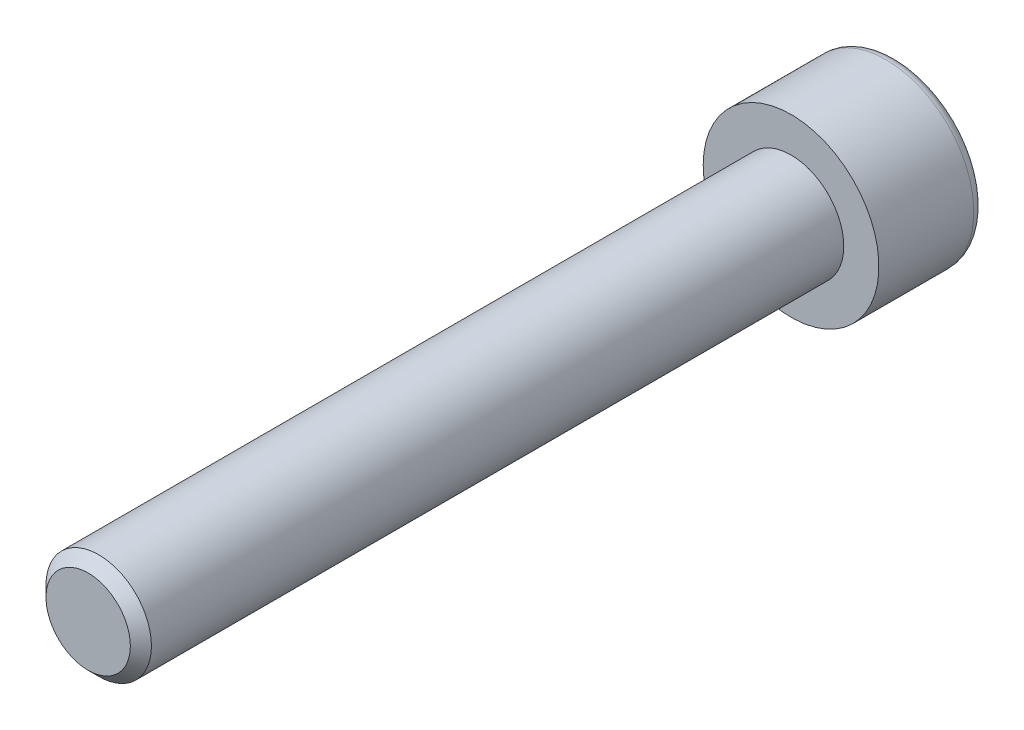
ISO-10303-21;
HEADER;
FILE_DESCRIPTION(('STEP AP214'),'2;1');
FILE_NAME('part.step','',(''),(''),'','','');
FILE_SCHEMA(('AUTOMOTIVE_DESIGN { 1 0 10303 214 1 1 1 1 }'));
ENDSEC;
DATA;
#1=APPLICATION_CONTEXT('core data for automotive mechanical design processes');
#2=APPLICATION_PROTOCOL_DEFINITION('international standard','automotive_design',2000,#1);
#3=PRODUCT_CONTEXT('',#1,'mechanical');
#4=PRODUCT('Part','Part','',(#3));
#5=PRODUCT_RELATED_PRODUCT_CATEGORY('part','',(#4));
#6=PRODUCT_DEFINITION_FORMATION('','',#4);
#7=PRODUCT_DEFINITION_CONTEXT('part definition',#1,'design');
#8=PRODUCT_DEFINITION('design','',#6,#7);
#9=PRODUCT_DEFINITION_SHAPE('','',#8);
#10=(LENGTH_UNIT() NAMED_UNIT(*) SI_UNIT(.MILLI.,.METRE.));
#11=(NAMED_UNIT(*) PLANE_ANGLE_UNIT() SI_UNIT($,.RADIAN.));
#12=(NAMED_UNIT(*) SI_UNIT($,.STERADIAN.) SOLID_ANGLE_UNIT());
#13=UNCERTAINTY_MEASURE_WITH_UNIT(LENGTH_MEASURE(1.E-05),#10,'distance_accuracy_value','');
#14=(GEOMETRIC_REPRESENTATION_CONTEXT(3) GLOBAL_UNCERTAINTY_ASSIGNED_CONTEXT((#13)) GLOBAL_UNIT_ASSIGNED_CONTEXT((#10,
#11,#12)) REPRESENTATION_CONTEXT('',''));
#15=CARTESIAN_POINT('',(0.,0.,0.));
#16=DIRECTION('',(0.,0.,1.));
#17=DIRECTION('',(1.,0.,0.));
#18=AXIS2_PLACEMENT_3D('',#15,#16,#17);
#19=CARTESIAN_POINT('',(4.44089209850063E-13,-1.11022302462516E-13,-5.9999999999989));
#20=DIRECTION('',(0.,0.,0.999999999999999));
#21=DIRECTION('',(0.999999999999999,0.,0.));
#22=AXIS2_PLACEMENT_3D('',#19,#20,#21);
#23=PLANE('',#22);
#24=CARTESIAN_POINT('',(4.44089209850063E-13,-1.11022302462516E-13,-5.9999999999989));
#25=DIRECTION('',(0.,0.,-0.999999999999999));
#26=DIRECTION('',(-0.999999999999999,0.,0.));
#27=AXIS2_PLACEMENT_3D('',#24,#25,#26);
#28=CIRCLE('',#27,4.4);
#29=CARTESIAN_POINT('',(-4.39999999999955,-1.135869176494E-13,-5.99999999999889));
#30=VERTEX_POINT('',#29);
#31=EDGE_CURVE('E146',#30,#30,#28,.T.);
#32=ORIENTED_EDGE('',*,*,#31,.T.);
#33=EDGE_LOOP('',(#32));
#34=FACE_BOUND('',#33,.T.);
#35=DIRECTION('',(-0.866025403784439,0.499999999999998,0.));
#36=VECTOR('',#35,1.);
#37=CARTESIAN_POINT('',(9.99200722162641E-13,2.88675134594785,-5.9999999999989));
#38=LINE('',#37,#36);
#39=CARTESIAN_POINT('',(2.50000000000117,1.44337567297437,-5.99999999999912));
#40=VERTEX_POINT('',#39);
#41=CARTESIAN_POINT('',(9.99200722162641E-13,2.88675134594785,-5.9999999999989));
#42=VERTEX_POINT('',#41);
#43=EDGE_CURVE('E50',#40,#42,#38,.T.);
#44=ORIENTED_EDGE('',*,*,#43,.T.);
#45=DIRECTION('',(-0.866025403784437,-0.500000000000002,0.));
#46=VECTOR('',#45,1.);
#47=CARTESIAN_POINT('',(9.99200722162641E-13,2.88675134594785,-5.9999999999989));
#48=LINE('',#47,#46);
#49=CARTESIAN_POINT('',(-2.49999999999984,1.44337567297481,-5.99999999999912));
#50=VERTEX_POINT('',#49);
#51=EDGE_CURVE('E90',#42,#50,#48,.T.);
#52=ORIENTED_EDGE('',*,*,#51,.T.);
#53=DIRECTION('',(0.,-1.,0.));
#54=VECTOR('',#53,1.);
#55=CARTESIAN_POINT('',(-2.50000000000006,-1.4433756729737,-5.9999999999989));
#56=LINE('',#55,#54);
#57=CARTESIAN_POINT('',(-2.50000000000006,-1.4433756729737,-5.9999999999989));
#58=VERTEX_POINT('',#57);
#59=EDGE_CURVE('E98',#50,#58,#56,.T.);
#60=ORIENTED_EDGE('',*,*,#59,.T.);
#61=DIRECTION('',(0.866025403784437,-0.500000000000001,0.));
#62=VECTOR('',#61,1.);
#63=CARTESIAN_POINT('',(1.11022302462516E-13,-2.88675134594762,-5.99999999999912));
#64=LINE('',#63,#62);
#65=CARTESIAN_POINT('',(1.11022302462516E-13,-2.88675134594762,-5.99999999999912));
#66=VERTEX_POINT('',#65);
#67=EDGE_CURVE('E116',#58,#66,#64,.T.);
#68=ORIENTED_EDGE('',*,*,#67,.T.);
#69=DIRECTION('',(0.866025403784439,0.499999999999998,0.));
#70=VECTOR('',#69,1.);
#71=CARTESIAN_POINT('',(1.11022302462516E-13,-2.88675134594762,-5.99999999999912));
#72=LINE('',#71,#70);
#73=CARTESIAN_POINT('',(2.50000000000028,-1.44337567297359,-5.99999999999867));
#74=VERTEX_POINT('',#73);
#75=EDGE_CURVE('E119',#66,#74,#72,.T.);
#76=ORIENTED_EDGE('',*,*,#75,.T.);
#77=DIRECTION('',(0.,1.,0.));
#78=VECTOR('',#77,1.);
#79=CARTESIAN_POINT('',(2.50000000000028,-1.44337567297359,-5.99999999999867));
#80=LINE('',#79,#78);
#81=EDGE_CURVE('E109',#74,#40,#80,.T.);
#82=ORIENTED_EDGE('',*,*,#81,.T.);
#83=EDGE_LOOP('',(#44,#52,#60,#68,#76,#82));
#84=FACE_BOUND('',#83,.T.);
#85=ADVANCED_FACE('F36',(#34,#84),#23,.F.);
#86=CARTESIAN_POINT('',(5.55111512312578E-13,0.,-5.39999999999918));
#87=DIRECTION('',(0.,0.,-0.999999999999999));
#88=DIRECTION('',(-0.999999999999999,0.,0.));
#89=AXIS2_PLACEMENT_3D('',#86,#87,#88);
#90=TOROIDAL_SURFACE('',#89,4.4,0.6);
#91=ORIENTED_EDGE('',*,*,#31,.F.);
#92=EDGE_LOOP('',(#91));
#93=FACE_BOUND('',#92,.T.);
#94=CARTESIAN_POINT('',(5.55111512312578E-13,0.,-5.39999999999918));
#95=DIRECTION('',(0.,0.,-0.999999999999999));
#96=DIRECTION('',(-0.999999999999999,0.,0.));
#97=AXIS2_PLACEMENT_3D('',#94,#95,#96);
#98=CIRCLE('',#97,5.);
#99=CARTESIAN_POINT('',(-4.99999999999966,-1.13636877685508E-13,-5.39999999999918));
#100=VERTEX_POINT('',#99);
#101=EDGE_CURVE('E143',#100,#100,#98,.T.);
#102=ORIENTED_EDGE('',*,*,#101,.T.);
#103=EDGE_LOOP('',(#102));
#104=FACE_BOUND('',#103,.T.);
#105=ADVANCED_FACE('F165',(#93,#104),#90,.T.);
#106=CARTESIAN_POINT('',(3.33066907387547E-13,-1.11022302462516E-13,4.44089209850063E-13));
#107=DIRECTION('',(0.,0.,-0.999999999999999));
#108=DIRECTION('',(-0.999999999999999,0.,0.));
#109=AXIS2_PLACEMENT_3D('',#106,#107,#108);
#110=CYLINDRICAL_SURFACE('',#109,5.);
#111=CARTESIAN_POINT('',(3.33066907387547E-13,-1.11022302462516E-13,4.44089209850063E-13));
#112=DIRECTION('',(0.,0.,-0.999999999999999));
#113=DIRECTION('',(-0.999999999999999,0.,0.));
#114=AXIS2_PLACEMENT_3D('',#111,#112,#113);
#115=CIRCLE('',#114,5.);
#116=CARTESIAN_POINT('',(-4.99999999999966,-1.13936637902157E-13,4.43256542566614E-13));
#117=VERTEX_POINT('',#116);
#118=EDGE_CURVE('E104',#117,#117,#115,.T.);
#119=CARTESIAN_POINT('',(-4.99999999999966,-1.13636877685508E-13,-5.39999999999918));
#120=CARTESIAN_POINT('',(-4.99999999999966,-1.13640000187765E-13,-5.34374999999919));
#121=CARTESIAN_POINT('',(-4.99999999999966,-1.13643122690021E-13,-5.28749999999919));
#122=CARTESIAN_POINT('',(-4.99999999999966,-1.13649367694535E-13,-5.1749999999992));
#123=CARTESIAN_POINT('',(-4.99999999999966,-1.13652490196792E-13,-5.1187499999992));
#124=CARTESIAN_POINT('',(-4.99999999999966,-1.13658735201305E-13,-5.00624999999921));
#125=CARTESIAN_POINT('',(-4.99999999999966,-1.13661857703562E-13,-4.94999999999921));
#126=CARTESIAN_POINT('',(-4.99999999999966,-1.13668102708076E-13,-4.83749999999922));
#127=CARTESIAN_POINT('',(-4.99999999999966,-1.13671225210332E-13,-4.78124999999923));
#128=CARTESIAN_POINT('',(-4.99999999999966,-1.13677470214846E-13,-4.66874999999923));
#129=CARTESIAN_POINT('',(-4.99999999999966,-1.13680592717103E-13,-4.61249999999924));
#130=CARTESIAN_POINT('',(-4.99999999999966,-1.13686837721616E-13,-4.49999999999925));
#131=CARTESIAN_POINT('',(-4.99999999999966,-1.13689960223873E-13,-4.44374999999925));
#132=CARTESIAN_POINT('',(-4.99999999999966,-1.13696205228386E-13,-4.33124999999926));
#133=CARTESIAN_POINT('',(-4.99999999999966,-1.13699327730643E-13,-4.27499999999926));
#134=CARTESIAN_POINT('',(-4.99999999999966,-1.13705572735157E-13,-4.16249999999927));
#135=CARTESIAN_POINT('',(-4.99999999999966,-1.13708695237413E-13,-4.10624999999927));
#136=CARTESIAN_POINT('',(-4.99999999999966,-1.13714940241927E-13,-3.99374999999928));
#137=CARTESIAN_POINT('',(-4.99999999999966,-1.13718062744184E-13,-3.93749999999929));
#138=CARTESIAN_POINT('',(-4.99999999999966,-1.13724307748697E-13,-3.82499999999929));
#139=CARTESIAN_POINT('',(-4.99999999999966,-1.13727430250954E-13,-3.7687499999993));
#140=CARTESIAN_POINT('',(-4.99999999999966,-1.13733675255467E-13,-3.6562499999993));
#141=CARTESIAN_POINT('',(-4.99999999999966,-1.13736797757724E-13,-3.59999999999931));
#142=CARTESIAN_POINT('',(-4.99999999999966,-1.13743042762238E-13,-3.48749999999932));
#143=CARTESIAN_POINT('',(-4.99999999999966,-1.13746165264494E-13,-3.43124999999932));
#144=CARTESIAN_POINT('',(-4.99999999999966,-1.13752410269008E-13,-3.31874999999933));
#145=CARTESIAN_POINT('',(-4.99999999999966,-1.13755532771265E-13,-3.26249999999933));
#146=CARTESIAN_POINT('',(-4.99999999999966,-1.13761777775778E-13,-3.14999999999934));
#147=CARTESIAN_POINT('',(-4.99999999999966,-1.13764900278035E-13,-3.09374999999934));
#148=CARTESIAN_POINT('',(-4.99999999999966,-1.13771145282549E-13,-2.98124999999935));
#149=CARTESIAN_POINT('',(-4.99999999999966,-1.13774267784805E-13,-2.92499999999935));
#150=CARTESIAN_POINT('',(-4.99999999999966,-1.13780512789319E-13,-2.81249999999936));
#151=CARTESIAN_POINT('',(-4.99999999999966,-1.13783635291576E-13,-2.75624999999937));
#152=CARTESIAN_POINT('',(-4.99999999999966,-1.13789880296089E-13,-2.64374999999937));
#153=CARTESIAN_POINT('',(-4.99999999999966,-1.13793002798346E-13,-2.58749999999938));
#154=CARTESIAN_POINT('',(-4.99999999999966,-1.13799247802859E-13,-2.47499999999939));
#155=CARTESIAN_POINT('',(-4.99999999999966,-1.13802370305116E-13,-2.41874999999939));
#156=CARTESIAN_POINT('',(-4.99999999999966,-1.1380861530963E-13,-2.3062499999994));
#157=CARTESIAN_POINT('',(-4.99999999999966,-1.13811737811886E-13,-2.2499999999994));
#158=CARTESIAN_POINT('',(-4.99999999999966,-1.138179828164E-13,-2.13749999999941));
#159=CARTESIAN_POINT('',(-4.99999999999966,-1.13821105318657E-13,-2.08124999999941));
#160=CARTESIAN_POINT('',(-4.99999999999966,-1.1382735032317E-13,-1.96874999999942));
#161=CARTESIAN_POINT('',(-4.99999999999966,-1.13830472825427E-13,-1.91249999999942));
#162=CARTESIAN_POINT('',(-4.99999999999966,-1.1383671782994E-13,-1.79999999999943));
#163=CARTESIAN_POINT('',(-4.99999999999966,-1.13839840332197E-13,-1.74374999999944));
#164=CARTESIAN_POINT('',(-4.99999999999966,-1.13846085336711E-13,-1.63124999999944));
#165=CARTESIAN_POINT('',(-4.99999999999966,-1.13849207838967E-13,-1.57499999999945));
#166=CARTESIAN_POINT('',(-4.99999999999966,-1.13855452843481E-13,-1.46249999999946));
#167=CARTESIAN_POINT('',(-4.99999999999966,-1.13858575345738E-13,-1.40624999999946));
#168=CARTESIAN_POINT('',(-4.99999999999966,-1.13864820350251E-13,-1.29374999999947));
#169=CARTESIAN_POINT('',(-4.99999999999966,-1.13867942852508E-13,-1.23749999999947));
#170=CARTESIAN_POINT('',(-4.99999999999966,-1.13874187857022E-13,-1.12499999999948));
#171=CARTESIAN_POINT('',(-4.99999999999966,-1.13877310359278E-13,-1.06874999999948));
#172=CARTESIAN_POINT('',(-4.99999999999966,-1.13883555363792E-13,-0.956249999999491));
#173=CARTESIAN_POINT('',(-4.99999999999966,-1.13886677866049E-13,-0.899999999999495));
#174=CARTESIAN_POINT('',(-4.99999999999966,-1.13892922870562E-13,-0.787499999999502));
#175=CARTESIAN_POINT('',(-4.99999999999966,-1.13896045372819E-13,-0.731249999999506));
#176=CARTESIAN_POINT('',(-4.99999999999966,-1.13902290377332E-13,-0.618749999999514));
#177=CARTESIAN_POINT('',(-4.99999999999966,-1.13905412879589E-13,-0.562499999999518));
#178=CARTESIAN_POINT('',(-4.99999999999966,-1.13911657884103E-13,-0.449999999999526));
#179=CARTESIAN_POINT('',(-4.99999999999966,-1.13914780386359E-13,-0.393749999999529));
#180=CARTESIAN_POINT('',(-4.99999999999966,-1.13921025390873E-13,-0.281249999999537));
#181=CARTESIAN_POINT('',(-4.99999999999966,-1.1392414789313E-13,-0.224999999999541));
#182=CARTESIAN_POINT('',(-4.99999999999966,-1.13930392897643E-13,-0.112499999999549));
#183=CARTESIAN_POINT('',(-4.99999999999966,-1.139335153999E-13,-0.0562499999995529));
#184=CARTESIAN_POINT('',(-4.99999999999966,-1.13936637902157E-13,4.43187153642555E-13));
#185=B_SPLINE_CURVE_WITH_KNOTS('',3,(#119,#120,#121,#122,#123,#124,#125,#126,#127,#128,#129,
#130,#131,#132,#133,#134,#135,#136,#137,#138,#139,#140,#141,#142,#143,#144,#145,#146,#147,#148,
#149,#150,#151,#152,#153,#154,#155,#156,#157,#158,#159,#160,#161,#162,#163,#164,#165,#166,#167,
#168,#169,#170,#171,#172,#173,#174,#175,#176,#177,#178,#179,#180,#181,#182,#183,#184),
.UNSPECIFIED.,.F.,.F.,(4,2,2,2,2,2,2,2,2,2,2,2,2,2,2,2,2,2,2,2,2,2,2,2,2,2,2,2,2,2,2,2,4),(0.,
0.168749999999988,0.337499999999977,0.506249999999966,0.674999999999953,0.843749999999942,
1.01249999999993,1.18124999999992,1.34999999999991,1.5187499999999,1.68749999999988,
1.85624999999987,2.02499999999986,2.19374999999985,2.36249999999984,2.53124999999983,
2.69999999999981,2.8687499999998,3.03749999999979,3.20624999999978,3.37499999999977,
3.54374999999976,3.71249999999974,3.88124999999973,4.04999999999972,4.21874999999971,
4.3874999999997,4.55624999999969,4.72499999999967,4.89374999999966,5.06249999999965,
5.23124999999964,5.39999999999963),.UNSPECIFIED.);
#186=EDGE_CURVE('BSEAM170',#100,#117,#185,.T.);
#187=ORIENTED_EDGE('',*,*,#101,.F.);
#188=ORIENTED_EDGE('',*,*,#118,.T.);
#189=ORIENTED_EDGE('',*,*,#186,.T.);
#190=ORIENTED_EDGE('',*,*,#186,.F.);
#191=EDGE_LOOP('',(#187,#189,#188,#190));
#192=FACE_BOUND('',#191,.T.);
#193=ADVANCED_FACE('F170',(#192),#110,.T.);
#194=CARTESIAN_POINT('',(3.33066907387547E-13,-1.11022302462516E-13,4.44089209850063E-13));
#195=DIRECTION('',(0.,0.,-0.999999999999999));
#196=DIRECTION('',(-0.999999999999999,0.,0.));
#197=AXIS2_PLACEMENT_3D('',#194,#195,#196);
#198=PLANE('',#197);
#199=CARTESIAN_POINT('',(3.33066907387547E-13,-1.11022302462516E-13,4.44089209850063E-13));
#200=DIRECTION('',(0.,0.,0.999999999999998));
#201=DIRECTION('',(0.999999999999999,0.,0.));
#202=AXIS2_PLACEMENT_3D('',#199,#200,#201);
#203=CIRCLE('',#202,3.);
#204=CARTESIAN_POINT('',(3.00000000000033,-1.09273701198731E-13,4.43922676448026E-13));
#205=VERTEX_POINT('',#204);
#206=EDGE_CURVE('E110',#205,#205,#203,.T.);
#207=ORIENTED_EDGE('',*,*,#206,.F.);
#208=EDGE_LOOP('',(#207));
#209=FACE_BOUND('',#208,.T.);
#210=ORIENTED_EDGE('',*,*,#118,.F.);
#211=EDGE_LOOP('',(#210));
#212=FACE_BOUND('',#211,.T.);
#213=ADVANCED_FACE('F178',(#209,#212),#198,.F.);
#214=CARTESIAN_POINT('',(9.99200722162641E-13,2.88675134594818,-2.99999999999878));
#215=DIRECTION('',(-0.499999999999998,-0.86602540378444,0.));
#216=DIRECTION('',(0.866025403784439,-0.499999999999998,0.));
#217=AXIS2_PLACEMENT_3D('',#214,#215,#216);
#218=PLANE('',#217);
#219=ORIENTED_EDGE('',*,*,#43,.F.);
#220=DIRECTION('',(0.,0.,-0.999999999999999));
#221=VECTOR('',#220,1.);
#222=CARTESIAN_POINT('',(2.50000000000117,1.44337567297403,-2.99999999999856));
#223=LINE('',#222,#221);
#224=CARTESIAN_POINT('',(2.50000000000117,1.44337567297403,-2.99999999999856));
#225=VERTEX_POINT('',#224);
#226=EDGE_CURVE('E132',#225,#40,#223,.T.);
#227=ORIENTED_EDGE('',*,*,#226,.F.);
#228=DIRECTION('',(-0.866025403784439,0.499999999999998,0.));
#229=VECTOR('',#228,1.);
#230=CARTESIAN_POINT('',(9.99200722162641E-13,2.88675134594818,-2.99999999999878));
#231=LINE('',#230,#229);
#232=CARTESIAN_POINT('',(9.99200722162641E-13,2.88675134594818,-2.99999999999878));
#233=VERTEX_POINT('',#232);
#234=EDGE_CURVE('E103',#225,#233,#231,.T.);
#235=ORIENTED_EDGE('',*,*,#234,.T.);
#236=DIRECTION('',(0.,0.,-0.999999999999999));
#237=VECTOR('',#236,1.);
#238=CARTESIAN_POINT('',(9.99200722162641E-13,2.88675134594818,-2.99999999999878));
#239=LINE('',#238,#237);
#240=EDGE_CURVE('E92',#233,#42,#239,.T.);
#241=ORIENTED_EDGE('',*,*,#240,.T.);
#242=EDGE_LOOP('',(#219,#227,#235,#241));
#243=FACE_BOUND('',#242,.T.);
#244=ADVANCED_FACE('F101',(#243),#218,.T.);
#245=CARTESIAN_POINT('',(9.99200722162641E-13,2.88675134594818,-2.99999999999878));
#246=DIRECTION('',(0.5,-0.866025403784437,0.));
#247=DIRECTION('',(0.866025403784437,0.500000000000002,0.));
#248=AXIS2_PLACEMENT_3D('',#245,#246,#247);
#249=PLANE('',#248);
#250=ORIENTED_EDGE('',*,*,#51,.F.);
#251=ORIENTED_EDGE('',*,*,#240,.F.);
#252=DIRECTION('',(-0.866025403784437,-0.500000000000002,0.));
#253=VECTOR('',#252,1.);
#254=CARTESIAN_POINT('',(9.99200722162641E-13,2.88675134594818,-2.99999999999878));
#255=LINE('',#254,#253);
#256=CARTESIAN_POINT('',(-2.49999999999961,1.4433756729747,-2.999999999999));
#257=VERTEX_POINT('',#256);
#258=EDGE_CURVE('E123',#233,#257,#255,.T.);
#259=ORIENTED_EDGE('',*,*,#258,.T.);
#260=DIRECTION('',(0.,0.,-0.999999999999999));
#261=VECTOR('',#260,1.);
#262=CARTESIAN_POINT('',(-2.49999999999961,1.4433756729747,-2.999999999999));
#263=LINE('',#262,#261);
#264=EDGE_CURVE('E94',#257,#50,#263,.T.);
#265=ORIENTED_EDGE('',*,*,#264,.T.);
#266=EDGE_LOOP('',(#250,#251,#259,#265));
#267=FACE_BOUND('',#266,.T.);
#268=ADVANCED_FACE('F91',(#267),#249,.T.);
#269=CARTESIAN_POINT('',(-2.50000000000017,-1.44337567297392,-2.99999999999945));
#270=DIRECTION('',(0.999999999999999,0.,0.));
#271=DIRECTION('',(0.,0.,-0.999999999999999));
#272=AXIS2_PLACEMENT_3D('',#269,#270,#271);
#273=PLANE('',#272);
#274=ORIENTED_EDGE('',*,*,#59,.F.);
#275=ORIENTED_EDGE('',*,*,#264,.F.);
#276=DIRECTION('',(0.,-1.,0.));
#277=VECTOR('',#276,1.);
#278=CARTESIAN_POINT('',(-2.50000000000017,-1.44337567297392,-2.99999999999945));
#279=LINE('',#278,#277);
#280=CARTESIAN_POINT('',(-2.50000000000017,-1.44337567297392,-2.99999999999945));
#281=VERTEX_POINT('',#280);
#282=EDGE_CURVE('E125',#257,#281,#279,.T.);
#283=ORIENTED_EDGE('',*,*,#282,.T.);
#284=DIRECTION('',(0.,0.,-0.999999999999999));
#285=VECTOR('',#284,1.);
#286=CARTESIAN_POINT('',(-2.50000000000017,-1.44337567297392,-2.99999999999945));
#287=LINE('',#286,#285);
#288=EDGE_CURVE('E138',#281,#58,#287,.T.);
#289=ORIENTED_EDGE('',*,*,#288,.T.);
#290=EDGE_LOOP('',(#274,#275,#283,#289));
#291=FACE_BOUND('',#290,.T.);
#292=ADVANCED_FACE('F193',(#291),#273,.T.);
#293=CARTESIAN_POINT('',(4.44089209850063E-13,-2.88675134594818,-2.99999999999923));
#294=DIRECTION('',(0.500000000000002,0.866025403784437,0.));
#295=DIRECTION('',(-0.866025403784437,0.500000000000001,0.));
#296=AXIS2_PLACEMENT_3D('',#293,#294,#295);
#297=PLANE('',#296);
#298=ORIENTED_EDGE('',*,*,#67,.F.);
#299=ORIENTED_EDGE('',*,*,#288,.F.);
#300=DIRECTION('',(0.866025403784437,-0.500000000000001,0.));
#301=VECTOR('',#300,1.);
#302=CARTESIAN_POINT('',(4.44089209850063E-13,-2.88675134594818,-2.99999999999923));
#303=LINE('',#302,#301);
#304=CARTESIAN_POINT('',(4.44089209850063E-13,-2.88675134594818,-2.99999999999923));
#305=VERTEX_POINT('',#304);
#306=EDGE_CURVE('E127',#281,#305,#303,.T.);
#307=ORIENTED_EDGE('',*,*,#306,.T.);
#308=DIRECTION('',(0.,0.,-0.999999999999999));
#309=VECTOR('',#308,1.);
#310=CARTESIAN_POINT('',(4.44089209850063E-13,-2.88675134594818,-2.99999999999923));
#311=LINE('',#310,#309);
#312=EDGE_CURVE('E136',#305,#66,#311,.T.);
#313=ORIENTED_EDGE('',*,*,#312,.T.);
#314=EDGE_LOOP('',(#298,#299,#307,#313));
#315=FACE_BOUND('',#314,.T.);
#316=ADVANCED_FACE('F196',(#315),#297,.T.);
#317=CARTESIAN_POINT('',(4.44089209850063E-13,-2.88675134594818,-2.99999999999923));
#318=DIRECTION('',(-0.499999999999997,0.86602540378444,0.));
#319=DIRECTION('',(-0.866025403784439,-0.499999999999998,0.));
#320=AXIS2_PLACEMENT_3D('',#317,#318,#319);
#321=PLANE('',#320);
#322=ORIENTED_EDGE('',*,*,#75,.F.);
#323=ORIENTED_EDGE('',*,*,#312,.F.);
#324=DIRECTION('',(0.866025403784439,0.499999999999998,0.));
#325=VECTOR('',#324,1.);
#326=CARTESIAN_POINT('',(4.44089209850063E-13,-2.88675134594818,-2.99999999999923));
#327=LINE('',#326,#325);
#328=CARTESIAN_POINT('',(2.5000000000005,-1.4433756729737,-2.999999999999));
#329=VERTEX_POINT('',#328);
#330=EDGE_CURVE('E129',#305,#329,#327,.T.);
#331=ORIENTED_EDGE('',*,*,#330,.T.);
#332=DIRECTION('',(0.,0.,-0.999999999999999));
#333=VECTOR('',#332,1.);
#334=CARTESIAN_POINT('',(2.5000000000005,-1.4433756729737,-2.999999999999));
#335=LINE('',#334,#333);
#336=EDGE_CURVE('E134',#329,#74,#335,.T.);
#337=ORIENTED_EDGE('',*,*,#336,.T.);
#338=EDGE_LOOP('',(#322,#323,#331,#337));
#339=FACE_BOUND('',#338,.T.);
#340=ADVANCED_FACE('F200',(#339),#321,.T.);
#341=CARTESIAN_POINT('',(2.5000000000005,-1.4433756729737,-2.999999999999));
#342=DIRECTION('',(-0.999999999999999,0.,0.));
#343=DIRECTION('',(0.,0.,0.999999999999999));
#344=AXIS2_PLACEMENT_3D('',#341,#342,#343);
#345=PLANE('',#344);
#346=ORIENTED_EDGE('',*,*,#81,.F.);
#347=ORIENTED_EDGE('',*,*,#336,.F.);
#348=DIRECTION('',(0.,1.,0.));
#349=VECTOR('',#348,1.);
#350=CARTESIAN_POINT('',(2.5000000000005,-1.4433756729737,-2.999999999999));
#351=LINE('',#350,#349);
#352=EDGE_CURVE('E57',#329,#225,#351,.T.);
#353=ORIENTED_EDGE('',*,*,#352,.T.);
#354=ORIENTED_EDGE('',*,*,#226,.T.);
#355=EDGE_LOOP('',(#346,#347,#353,#354));
#356=FACE_BOUND('',#355,.T.);
#357=ADVANCED_FACE('F204',(#356),#345,.T.);
#358=CARTESIAN_POINT('',(2.50000000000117,1.44337567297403,-2.99999999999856));
#359=DIRECTION('',(0.,0.,0.999999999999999));
#360=DIRECTION('',(0.999999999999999,0.,0.));
#361=AXIS2_PLACEMENT_3D('',#358,#359,#360);
#362=PLANE('',#361);
#363=ORIENTED_EDGE('',*,*,#234,.F.);
#364=ORIENTED_EDGE('',*,*,#352,.F.);
#365=ORIENTED_EDGE('',*,*,#330,.F.);
#366=ORIENTED_EDGE('',*,*,#306,.F.);
#367=ORIENTED_EDGE('',*,*,#282,.F.);
#368=ORIENTED_EDGE('',*,*,#258,.F.);
#369=EDGE_LOOP('',(#363,#364,#365,#366,#367,#368));
#370=FACE_BOUND('',#369,.T.);
#371=ADVANCED_FACE('F208',(#370),#362,.F.);
#372=CARTESIAN_POINT('',(3.33066907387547E-13,0.,40.0000000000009));
#373=DIRECTION('',(0.,0.,0.999999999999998));
#374=DIRECTION('',(0.999999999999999,0.,0.));
#375=AXIS2_PLACEMENT_3D('',#372,#373,#374);
#376=PLANE('',#375);
#377=CARTESIAN_POINT('',(3.33066907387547E-13,0.,40.0000000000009));
#378=DIRECTION('',(0.,0.,0.999999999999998));
#379=DIRECTION('',(0.999999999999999,0.,0.));
#380=AXIS2_PLACEMENT_3D('',#377,#378,#379);
#381=CIRCLE('',#380,2.39999999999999);
#382=CARTESIAN_POINT('',(2.40000000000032,0.,40.0000000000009));
#383=VERTEX_POINT('',#382);
#384=EDGE_CURVE('E43',#383,#383,#381,.T.);
#385=ORIENTED_EDGE('',*,*,#384,.T.);
#386=EDGE_LOOP('',(#385));
#387=FACE_BOUND('',#386,.T.);
#388=ADVANCED_FACE('F151',(#387),#376,.T.);
#389=CARTESIAN_POINT('',(3.33066907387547E-13,-1.11022302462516E-13,4.44089209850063E-13));
#390=DIRECTION('',(0.,0.,0.999999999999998));
#391=DIRECTION('',(0.999999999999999,0.,0.));
#392=AXIS2_PLACEMENT_3D('',#389,#390,#391);
#393=CYLINDRICAL_SURFACE('',#392,3.);
#394=CARTESIAN_POINT('',(7.7715611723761E-13,1.11022302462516E-13,39.400000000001));
#395=DIRECTION('',(0.,0.,0.999999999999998));
#396=DIRECTION('',(0.999999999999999,0.,0.));
#397=AXIS2_PLACEMENT_3D('',#394,#395,#396);
#398=CIRCLE('',#397,3.);
#399=CARTESIAN_POINT('',(3.00000000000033,-1.04899422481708E-13,39.400000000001));
#400=VERTEX_POINT('',#399);
#401=EDGE_CURVE('E11',#400,#400,#398,.F.);
#402=CARTESIAN_POINT('',(3.00000000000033,-1.04899422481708E-13,39.400000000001));
#403=CARTESIAN_POINT('',(3.00000000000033,-1.0494498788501E-13,38.9895833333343));
#404=CARTESIAN_POINT('',(3.00000000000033,-1.04990553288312E-13,38.5791666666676));
#405=CARTESIAN_POINT('',(3.00000000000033,-1.05081684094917E-13,37.7583333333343));
#406=CARTESIAN_POINT('',(3.00000000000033,-1.05127249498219E-13,37.3479166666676));
#407=CARTESIAN_POINT('',(3.00000000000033,-1.05218380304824E-13,36.5270833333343));
#408=CARTESIAN_POINT('',(3.00000000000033,-1.05263945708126E-13,36.1166666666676));
#409=CARTESIAN_POINT('',(3.00000000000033,-1.05355076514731E-13,35.2958333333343));
#410=CARTESIAN_POINT('',(3.00000000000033,-1.05400641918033E-13,34.8854166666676));
#411=CARTESIAN_POINT('',(3.00000000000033,-1.05491772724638E-13,34.0645833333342));
#412=CARTESIAN_POINT('',(3.00000000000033,-1.0553733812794E-13,33.6541666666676));
#413=CARTESIAN_POINT('',(3.00000000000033,-1.05628468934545E-13,32.8333333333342));
#414=CARTESIAN_POINT('',(3.00000000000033,-1.05674034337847E-13,32.4229166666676));
#415=CARTESIAN_POINT('',(3.00000000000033,-1.05765165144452E-13,31.6020833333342));
#416=CARTESIAN_POINT('',(3.00000000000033,-1.05810730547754E-13,31.1916666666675));
#417=CARTESIAN_POINT('',(3.00000000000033,-1.05901861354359E-13,30.3708333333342));
#418=CARTESIAN_POINT('',(3.00000000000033,-1.05947426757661E-13,29.9604166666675));
#419=CARTESIAN_POINT('',(3.00000000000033,-1.06038557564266E-13,29.1395833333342));
#420=CARTESIAN_POINT('',(3.00000000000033,-1.06084122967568E-13,28.7291666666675));
#421=CARTESIAN_POINT('',(3.00000000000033,-1.06175253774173E-13,27.9083333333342));
#422=CARTESIAN_POINT('',(3.00000000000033,-1.06220819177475E-13,27.4979166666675));
#423=CARTESIAN_POINT('',(3.00000000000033,-1.0631194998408E-13,26.6770833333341));
#424=CARTESIAN_POINT('',(3.00000000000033,-1.06357515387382E-13,26.2666666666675));
#425=CARTESIAN_POINT('',(3.00000000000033,-1.06448646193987E-13,25.4458333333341));
#426=CARTESIAN_POINT('',(3.00000000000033,-1.06494211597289E-13,25.0354166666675));
#427=CARTESIAN_POINT('',(3.00000000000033,-1.06585342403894E-13,24.2145833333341));
#428=CARTESIAN_POINT('',(3.00000000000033,-1.06630907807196E-13,23.8041666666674));
#429=CARTESIAN_POINT('',(3.00000000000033,-1.06722038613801E-13,22.9833333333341));
#430=CARTESIAN_POINT('',(3.00000000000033,-1.06767604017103E-13,22.5729166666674));
#431=CARTESIAN_POINT('',(3.00000000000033,-1.06858734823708E-13,21.7520833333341));
#432=CARTESIAN_POINT('',(3.00000000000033,-1.0690430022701E-13,21.3416666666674));
#433=CARTESIAN_POINT('',(3.00000000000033,-1.06995431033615E-13,20.5208333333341));
#434=CARTESIAN_POINT('',(3.00000000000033,-1.07040996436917E-13,20.1104166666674));
#435=CARTESIAN_POINT('',(3.00000000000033,-1.07132127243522E-13,19.289583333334));
#436=CARTESIAN_POINT('',(3.00000000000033,-1.07177692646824E-13,18.8791666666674));
#437=CARTESIAN_POINT('',(3.00000000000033,-1.07268823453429E-13,18.058333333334));
#438=CARTESIAN_POINT('',(3.00000000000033,-1.07314388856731E-13,17.6479166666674));
#439=CARTESIAN_POINT('',(3.00000000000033,-1.07405519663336E-13,16.827083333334));
#440=CARTESIAN_POINT('',(3.00000000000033,-1.07451085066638E-13,16.4166666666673));
#441=CARTESIAN_POINT('',(3.00000000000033,-1.07542215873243E-13,15.595833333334));
#442=CARTESIAN_POINT('',(3.00000000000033,-1.07587781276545E-13,15.1854166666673));
#443=CARTESIAN_POINT('',(3.00000000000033,-1.0767891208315E-13,14.364583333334));
#444=CARTESIAN_POINT('',(3.00000000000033,-1.07724477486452E-13,13.9541666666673));
#445=CARTESIAN_POINT('',(3.00000000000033,-1.07815608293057E-13,13.133333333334));
#446=CARTESIAN_POINT('',(3.00000000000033,-1.07861173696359E-13,12.7229166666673));
#447=CARTESIAN_POINT('',(3.00000000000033,-1.07952304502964E-13,11.9020833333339));
#448=CARTESIAN_POINT('',(3.00000000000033,-1.07997869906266E-13,11.4916666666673));
#449=CARTESIAN_POINT('',(3.00000000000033,-1.08089000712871E-13,10.6708333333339));
#450=CARTESIAN_POINT('',(3.00000000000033,-1.08134566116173E-13,10.2604166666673));
#451=CARTESIAN_POINT('',(3.00000000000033,-1.08225696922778E-13,9.43958333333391));
#452=CARTESIAN_POINT('',(3.00000000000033,-1.0827126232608E-13,9.02916666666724));
#453=CARTESIAN_POINT('',(3.00000000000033,-1.08362393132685E-13,8.20833333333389));
#454=CARTESIAN_POINT('',(3.00000000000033,-1.08407958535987E-13,7.79791666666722));
#455=CARTESIAN_POINT('',(3.00000000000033,-1.08499089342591E-13,6.97708333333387));
#456=CARTESIAN_POINT('',(3.00000000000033,-1.08544654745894E-13,6.5666666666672));
#457=CARTESIAN_POINT('',(3.00000000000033,-1.08635785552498E-13,5.74583333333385));
#458=CARTESIAN_POINT('',(3.00000000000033,-1.08681350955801E-13,5.33541666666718));
#459=CARTESIAN_POINT('',(3.00000000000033,-1.08772481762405E-13,4.51458333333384));
#460=CARTESIAN_POINT('',(3.00000000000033,-1.08818047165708E-13,4.10416666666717));
#461=CARTESIAN_POINT('',(3.00000000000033,-1.08909177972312E-13,3.28333333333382));
#462=CARTESIAN_POINT('',(3.00000000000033,-1.08954743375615E-13,2.87291666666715));
#463=CARTESIAN_POINT('',(3.00000000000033,-1.09045874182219E-13,2.0520833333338));
#464=CARTESIAN_POINT('',(3.00000000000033,-1.09091439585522E-13,1.64166666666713));
#465=CARTESIAN_POINT('',(3.00000000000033,-1.09182570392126E-13,0.820833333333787));
#466=CARTESIAN_POINT('',(3.00000000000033,-1.09228135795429E-13,0.410416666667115));
#467=CARTESIAN_POINT('',(3.00000000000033,-1.09273701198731E-13,4.43256542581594E-13));
#468=B_SPLINE_CURVE_WITH_KNOTS('',3,(#402,#403,#404,#405,#406,#407,#408,#409,#410,#411,#412,
#413,#414,#415,#416,#417,#418,#419,#420,#421,#422,#423,#424,#425,#426,#427,#428,#429,#430,#431,
#432,#433,#434,#435,#436,#437,#438,#439,#440,#441,#442,#443,#444,#445,#446,#447,#448,#449,#450,
#451,#452,#453,#454,#455,#456,#457,#458,#459,#460,#461,#462,#463,#464,#465,#466,#467),
.UNSPECIFIED.,.F.,.F.,(4,2,2,2,2,2,2,2,2,2,2,2,2,2,2,2,2,2,2,2,2,2,2,2,2,2,2,2,2,2,2,2,4),(0.,
1.23125000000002,2.46250000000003,3.69375000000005,4.92500000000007,6.15625000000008,
7.3875000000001,8.61875000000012,9.85000000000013,11.0812500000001,12.3125000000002,
13.5437500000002,14.7750000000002,16.0062500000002,17.2375000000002,18.4687500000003,
19.7000000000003,20.9312500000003,22.1625000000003,23.3937500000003,24.6250000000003,
25.8562500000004,27.0875000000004,28.3187500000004,29.5500000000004,30.7812500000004,
32.0125000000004,33.2437500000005,34.4750000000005,35.7062500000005,36.9375000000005,
38.1687500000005,39.4000000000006),.UNSPECIFIED.);
#469=EDGE_CURVE('BSEAM155',#400,#205,#468,.T.);
#470=ORIENTED_EDGE('',*,*,#401,.T.);
#471=ORIENTED_EDGE('',*,*,#206,.T.);
#472=ORIENTED_EDGE('',*,*,#469,.T.);
#473=ORIENTED_EDGE('',*,*,#469,.F.);
#474=EDGE_LOOP('',(#470,#472,#471,#473));
#475=FACE_BOUND('',#474,.T.);
#476=ADVANCED_FACE('F155',(#475),#393,.T.);
#477=CARTESIAN_POINT('',(3.33066907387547E-13,0.,40.0000000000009));
#478=DIRECTION('',(0.,0.,-0.999999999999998));
#479=DIRECTION('',(-0.999999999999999,0.,0.));
#480=AXIS2_PLACEMENT_3D('',#477,#478,#479);
#481=CONICAL_SURFACE('',#480,2.39999999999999,0.785398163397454);
#482=ORIENTED_EDGE('',*,*,#401,.F.);
#483=EDGE_LOOP('',(#482));
#484=FACE_BOUND('',#483,.T.);
#485=ORIENTED_EDGE('',*,*,#384,.F.);
#486=EDGE_LOOP('',(#485));
#487=FACE_BOUND('',#486,.T.);
#488=ADVANCED_FACE('F153',(#484,#487),#481,.T.);
#489=CLOSED_SHELL('',(#85,#105,#193,#213,#244,#268,#292,#316,#340,#357,#371,#388,#476,#488));
#490=MANIFOLD_SOLID_BREP('B2',#489);
#491=ADVANCED_BREP_SHAPE_REPRESENTATION('',(#18,#490),#14);
#492=SHAPE_DEFINITION_REPRESENTATION(#9,#491);
ENDSEC;
END-ISO-10303-21;
